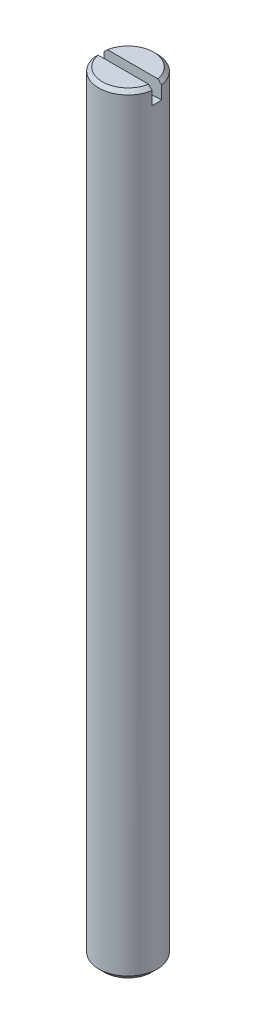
ISO-10303-21;
HEADER;
FILE_DESCRIPTION(('STEP AP214'),'2;1');
FILE_NAME('part.step','',(''),(''),'','','');
FILE_SCHEMA(('AUTOMOTIVE_DESIGN { 1 0 10303 214 1 1 1 1 }'));
ENDSEC;
DATA;
#1=APPLICATION_CONTEXT('core data for automotive mechanical design processes');
#2=APPLICATION_PROTOCOL_DEFINITION('international standard','automotive_design',2000,#1);
#3=PRODUCT_CONTEXT('',#1,'mechanical');
#4=PRODUCT('Part','Part','',(#3));
#5=PRODUCT_RELATED_PRODUCT_CATEGORY('part','',(#4));
#6=PRODUCT_DEFINITION_FORMATION('','',#4);
#7=PRODUCT_DEFINITION_CONTEXT('part definition',#1,'design');
#8=PRODUCT_DEFINITION('design','',#6,#7);
#9=PRODUCT_DEFINITION_SHAPE('','',#8);
#10=(LENGTH_UNIT() NAMED_UNIT(*) SI_UNIT(.MILLI.,.METRE.));
#11=(NAMED_UNIT(*) PLANE_ANGLE_UNIT() SI_UNIT($,.RADIAN.));
#12=(NAMED_UNIT(*) SI_UNIT($,.STERADIAN.) SOLID_ANGLE_UNIT());
#13=UNCERTAINTY_MEASURE_WITH_UNIT(LENGTH_MEASURE(1.E-05),#10,'distance_accuracy_value','');
#14=(GEOMETRIC_REPRESENTATION_CONTEXT(3) GLOBAL_UNCERTAINTY_ASSIGNED_CONTEXT((#13)) GLOBAL_UNIT_ASSIGNED_CONTEXT((#10,
#11,#12)) REPRESENTATION_CONTEXT('',''));
#15=CARTESIAN_POINT('',(0.,0.,0.));
#16=DIRECTION('',(0.,0.,1.));
#17=DIRECTION('',(1.,0.,0.));
#18=AXIS2_PLACEMENT_3D('',#15,#16,#17);
#19=CARTESIAN_POINT('',(0.,36.,0.));
#20=DIRECTION('',(0.,-1.,0.));
#21=DIRECTION('',(0.,0.,-1.));
#22=AXIS2_PLACEMENT_3D('',#19,#20,#21);
#23=PLANE('',#22);
#24=CARTESIAN_POINT('',(0.,36.0000000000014,0.));
#25=DIRECTION('',(0.,-1.,0.));
#26=DIRECTION('',(0.,0.,-1.));
#27=AXIS2_PLACEMENT_3D('',#24,#25,#26);
#28=CIRCLE('',#27,2.19349999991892);
#29=CARTESIAN_POINT('',(-2.15672025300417,35.9999999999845,-0.4));
#30=VERTEX_POINT('',#29);
#31=CARTESIAN_POINT('',(2.15672025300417,35.9999999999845,-0.4));
#32=VERTEX_POINT('',#31);
#33=EDGE_CURVE('E165',#30,#32,#28,.T.);
#34=ORIENTED_EDGE('',*,*,#33,.F.);
#35=DIRECTION('',(1.,0.,0.));
#36=VECTOR('',#35,1.);
#37=CARTESIAN_POINT('',(0.,36.,-0.4));
#38=LINE('',#37,#36);
#39=EDGE_CURVE('E163',#32,#30,#38,.F.);
#40=ORIENTED_EDGE('',*,*,#39,.F.);
#41=EDGE_LOOP('',(#34,#40));
#42=FACE_BOUND('',#41,.T.);
#43=ADVANCED_FACE('F14',(#42),#23,.F.);
#44=CARTESIAN_POINT('',(0.,36.,0.));
#45=DIRECTION('',(0.,-1.,0.));
#46=DIRECTION('',(0.,0.,-1.));
#47=AXIS2_PLACEMENT_3D('',#44,#45,#46);
#48=PLANE('',#47);
#49=DIRECTION('',(1.,0.,0.));
#50=VECTOR('',#49,1.);
#51=CARTESIAN_POINT('',(0.,36.,0.4));
#52=LINE('',#51,#50);
#53=CARTESIAN_POINT('',(-2.15672025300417,35.9999999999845,0.4));
#54=VERTEX_POINT('',#53);
#55=CARTESIAN_POINT('',(2.15672025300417,35.9999999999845,0.4));
#56=VERTEX_POINT('',#55);
#57=EDGE_CURVE('E161',#54,#56,#52,.T.);
#58=ORIENTED_EDGE('',*,*,#57,.F.);
#59=CARTESIAN_POINT('',(0.,36.0000000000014,0.));
#60=DIRECTION('',(0.,-1.,0.));
#61=DIRECTION('',(0.,0.,-1.));
#62=AXIS2_PLACEMENT_3D('',#59,#60,#61);
#63=CIRCLE('',#62,2.19349999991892);
#64=EDGE_CURVE('E159',#56,#54,#63,.T.);
#65=ORIENTED_EDGE('',*,*,#64,.F.);
#66=EDGE_LOOP('',(#58,#65));
#67=FACE_BOUND('',#66,.T.);
#68=ADVANCED_FACE('F121',(#67),#48,.F.);
#69=CARTESIAN_POINT('',(0.,35.6934999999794,0.));
#70=DIRECTION('',(0.,-1.,0.));
#71=DIRECTION('',(0.,0.,-1.));
#72=AXIS2_PLACEMENT_3D('',#69,#70,#71);
#73=CONICAL_SURFACE('',#72,2.49999999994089,0.785398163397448);
#74=CARTESIAN_POINT('',(-2.15672025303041,35.9999999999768,-0.400000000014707));
#75=CARTESIAN_POINT('',(-2.20861576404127,35.9489675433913,-0.400000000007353));
#76=CARTESIAN_POINT('',(-2.26048621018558,35.8979096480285,-0.400000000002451));
#77=CARTESIAN_POINT('',(-2.36417697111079,35.7957429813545,-0.399999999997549));
#78=CARTESIAN_POINT('',(-2.41599728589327,35.7446342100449,-0.399999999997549));
#79=CARTESIAN_POINT('',(-2.46779253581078,35.6934999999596,-0.4));
#80=B_SPLINE_CURVE_WITH_KNOTS('',3,(#74,#75,#76,#77,#78,#79),.UNSPECIFIED.,.F.,.F.,(4,2,4),(0.,
0.218350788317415,0.436701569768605),.UNSPECIFIED.);
#81=CARTESIAN_POINT('',(-2.46779253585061,35.6934999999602,-0.4));
#82=VERTEX_POINT('',#81);
#83=EDGE_CURVE('E39',#30,#82,#80,.T.);
#84=ORIENTED_EDGE('',*,*,#83,.F.);
#85=ORIENTED_EDGE('',*,*,#33,.T.);
#86=CARTESIAN_POINT('',(2.46779253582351,35.6934999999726,-0.400000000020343));
#87=CARTESIAN_POINT('',(2.41599728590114,35.7446342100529,-0.400000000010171));
#88=CARTESIAN_POINT('',(2.36417697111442,35.7957429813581,-0.400000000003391));
#89=CARTESIAN_POINT('',(2.26048621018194,35.8979096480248,-0.39999999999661));
#90=CARTESIAN_POINT('',(2.20861576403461,35.9489675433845,-0.39999999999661));
#91=CARTESIAN_POINT('',(2.15672025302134,35.9999999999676,-0.4));
#92=B_SPLINE_CURVE_WITH_KNOTS('',3,(#86,#87,#88,#89,#90,#91),.UNSPECIFIED.,.F.,.F.,(4,2,4),(0.,
0.218350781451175,0.436701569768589),.UNSPECIFIED.);
#93=CARTESIAN_POINT('',(2.46779253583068,35.6934999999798,-0.4));
#94=VERTEX_POINT('',#93);
#95=EDGE_CURVE('E134',#94,#32,#92,.T.);
#96=ORIENTED_EDGE('',*,*,#95,.F.);
#97=CARTESIAN_POINT('',(0.,35.6935,0.));
#98=DIRECTION('',(0.,-1.,0.));
#99=DIRECTION('',(0.,0.,-1.));
#100=AXIS2_PLACEMENT_3D('',#97,#98,#99);
#101=CIRCLE('',#100,2.5);
#102=EDGE_CURVE('E9',#82,#94,#101,.T.);
#103=ORIENTED_EDGE('',*,*,#102,.F.);
#104=EDGE_LOOP('',(#84,#85,#96,#103));
#105=FACE_BOUND('',#104,.T.);
#106=ADVANCED_FACE('F116',(#105),#73,.T.);
#107=CARTESIAN_POINT('',(0.,66.,-0.4));
#108=DIRECTION('',(0.,0.,1.));
#109=DIRECTION('',(1.,0.,0.));
#110=AXIS2_PLACEMENT_3D('',#107,#108,#109);
#111=PLANE('',#110);
#112=ORIENTED_EDGE('',*,*,#39,.T.);
#113=ORIENTED_EDGE('',*,*,#83,.T.);
#114=DIRECTION('',(0.,1.,0.));
#115=VECTOR('',#114,1.);
#116=CARTESIAN_POINT('',(-2.46779253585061,66.,-0.4));
#117=LINE('',#116,#115);
#118=CARTESIAN_POINT('',(-2.46779253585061,34.596815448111,-0.4));
#119=VERTEX_POINT('',#118);
#120=EDGE_CURVE('E154',#82,#119,#117,.F.);
#121=ORIENTED_EDGE('',*,*,#120,.T.);
#122=CARTESIAN_POINT('',(0.,66.,-0.4));
#123=DIRECTION('',(0.,0.,-1.));
#124=DIRECTION('',(-1.,0.,0.));
#125=AXIS2_PLACEMENT_3D('',#122,#123,#124);
#126=CIRCLE('',#125,31.5);
#127=CARTESIAN_POINT('',(2.46779253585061,34.596815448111,-0.4));
#128=VERTEX_POINT('',#127);
#129=EDGE_CURVE('E88',#119,#128,#126,.F.);
#130=ORIENTED_EDGE('',*,*,#129,.T.);
#131=DIRECTION('',(0.,1.,0.));
#132=VECTOR('',#131,1.);
#133=CARTESIAN_POINT('',(2.46779253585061,66.,-0.4));
#134=LINE('',#133,#132);
#135=EDGE_CURVE('E140',#128,#94,#134,.T.);
#136=ORIENTED_EDGE('',*,*,#135,.T.);
#137=ORIENTED_EDGE('',*,*,#95,.T.);
#138=EDGE_LOOP('',(#112,#113,#121,#130,#136,#137));
#139=FACE_BOUND('',#138,.T.);
#140=ADVANCED_FACE('F120',(#139),#111,.T.);
#141=CARTESIAN_POINT('',(0.,35.6934999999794,0.));
#142=DIRECTION('',(0.,-1.,0.));
#143=DIRECTION('',(0.,0.,-1.));
#144=AXIS2_PLACEMENT_3D('',#141,#142,#143);
#145=CONICAL_SURFACE('',#144,2.49999999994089,0.785398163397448);
#146=ORIENTED_EDGE('',*,*,#64,.T.);
#147=CARTESIAN_POINT('',(-2.15672025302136,35.9999999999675,0.4));
#148=CARTESIAN_POINT('',(-2.20861576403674,35.9489675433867,0.4));
#149=CARTESIAN_POINT('',(-2.26048621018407,35.8979096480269,0.4));
#150=CARTESIAN_POINT('',(-2.36417697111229,35.795742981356,0.4));
#151=CARTESIAN_POINT('',(-2.41599728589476,35.7446342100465,0.4));
#152=CARTESIAN_POINT('',(-2.46779253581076,35.6934999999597,0.4));
#153=B_SPLINE_CURVE_WITH_KNOTS('',3,(#147,#148,#149,#150,#151,#152),.UNSPECIFIED.,.F.,.F.,(4,2,
4),(0.,0.218350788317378,0.436701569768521),.UNSPECIFIED.);
#154=CARTESIAN_POINT('',(-2.46779253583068,35.6934999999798,0.4));
#155=VERTEX_POINT('',#154);
#156=EDGE_CURVE('E149',#54,#155,#153,.T.);
#157=ORIENTED_EDGE('',*,*,#156,.T.);
#158=CARTESIAN_POINT('',(0.,35.6935,0.));
#159=DIRECTION('',(0.,-1.,0.));
#160=DIRECTION('',(0.,0.,-1.));
#161=AXIS2_PLACEMENT_3D('',#158,#159,#160);
#162=CIRCLE('',#161,2.5);
#163=CARTESIAN_POINT('',(2.46779253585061,35.6934999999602,0.4));
#164=VERTEX_POINT('',#163);
#165=EDGE_CURVE('E30',#164,#155,#162,.T.);
#166=ORIENTED_EDGE('',*,*,#165,.F.);
#167=CARTESIAN_POINT('',(2.46779253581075,35.6934999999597,0.4));
#168=CARTESIAN_POINT('',(2.41599728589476,35.7446342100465,0.4));
#169=CARTESIAN_POINT('',(2.36417697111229,35.795742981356,0.4));
#170=CARTESIAN_POINT('',(2.26048621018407,35.8979096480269,0.4));
#171=CARTESIAN_POINT('',(2.20861576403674,35.9489675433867,0.4));
#172=CARTESIAN_POINT('',(2.15672025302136,35.9999999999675,0.4));
#173=B_SPLINE_CURVE_WITH_KNOTS('',3,(#167,#168,#169,#170,#171,#172),.UNSPECIFIED.,.F.,.F.,(4,2,
4),(0.,0.218350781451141,0.436701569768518),.UNSPECIFIED.);
#174=EDGE_CURVE('E96',#164,#56,#173,.T.);
#175=ORIENTED_EDGE('',*,*,#174,.T.);
#176=EDGE_LOOP('',(#146,#157,#166,#175));
#177=FACE_BOUND('',#176,.T.);
#178=ADVANCED_FACE('F122',(#177),#145,.T.);
#179=CARTESIAN_POINT('',(0.,66.,0.4));
#180=DIRECTION('',(0.,0.,1.));
#181=DIRECTION('',(1.,0.,0.));
#182=AXIS2_PLACEMENT_3D('',#179,#180,#181);
#183=PLANE('',#182);
#184=ORIENTED_EDGE('',*,*,#57,.T.);
#185=ORIENTED_EDGE('',*,*,#174,.F.);
#186=DIRECTION('',(0.,1.,0.));
#187=VECTOR('',#186,1.);
#188=CARTESIAN_POINT('',(2.46779253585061,66.,0.4));
#189=LINE('',#188,#187);
#190=CARTESIAN_POINT('',(2.46779253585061,34.596815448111,0.4));
#191=VERTEX_POINT('',#190);
#192=EDGE_CURVE('E94',#191,#164,#189,.T.);
#193=ORIENTED_EDGE('',*,*,#192,.F.);
#194=CARTESIAN_POINT('',(0.,66.,0.4));
#195=DIRECTION('',(0.,0.,-1.));
#196=DIRECTION('',(-1.,0.,0.));
#197=AXIS2_PLACEMENT_3D('',#194,#195,#196);
#198=CIRCLE('',#197,31.5);
#199=CARTESIAN_POINT('',(-2.46779253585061,34.596815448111,0.4));
#200=VERTEX_POINT('',#199);
#201=EDGE_CURVE('E81',#200,#191,#198,.F.);
#202=ORIENTED_EDGE('',*,*,#201,.F.);
#203=DIRECTION('',(0.,1.,0.));
#204=VECTOR('',#203,1.);
#205=CARTESIAN_POINT('',(-2.46779253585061,66.,0.4));
#206=LINE('',#205,#204);
#207=EDGE_CURVE('E73',#155,#200,#206,.F.);
#208=ORIENTED_EDGE('',*,*,#207,.F.);
#209=ORIENTED_EDGE('',*,*,#156,.F.);
#210=EDGE_LOOP('',(#184,#185,#193,#202,#208,#209));
#211=FACE_BOUND('',#210,.T.);
#212=ADVANCED_FACE('F92',(#211),#183,.F.);
#213=CARTESIAN_POINT('',(0.,66.,0.4));
#214=DIRECTION('',(0.,0.,-1.));
#215=DIRECTION('',(-1.,0.,0.));
#216=AXIS2_PLACEMENT_3D('',#213,#214,#215);
#217=CYLINDRICAL_SURFACE('',#216,31.5);
#218=CARTESIAN_POINT('',(2.46779253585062,34.596815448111,-0.4));
#219=CARTESIAN_POINT('',(2.47854531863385,34.5976618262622,-0.333698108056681));
#220=CARTESIAN_POINT('',(2.48661458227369,34.598300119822,-0.266959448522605));
#221=CARTESIAN_POINT('',(2.49732458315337,34.5991493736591,-0.133478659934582));
#222=CARTESIAN_POINT('',(2.5,34.5993630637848,-0.066739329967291));
#223=CARTESIAN_POINT('',(2.5,34.5993630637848,0.066739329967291));
#224=CARTESIAN_POINT('',(2.49732458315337,34.5991493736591,0.133478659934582));
#225=CARTESIAN_POINT('',(2.48661458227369,34.598300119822,0.266959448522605));
#226=CARTESIAN_POINT('',(2.47854531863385,34.5976618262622,0.333698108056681));
#227=CARTESIAN_POINT('',(2.46779253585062,34.596815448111,0.4));
#228=B_SPLINE_CURVE_WITH_KNOTS('',3,(#218,#219,#220,#221,#222,#223,#224,#225,#226,#227),
.UNSPECIFIED.,.F.,.F.,(4,2,2,2,4),(0.,0.201464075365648,0.401628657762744,0.601793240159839,
0.803257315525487),.UNSPECIFIED.);
#229=EDGE_CURVE('E82',#128,#191,#228,.T.);
#230=ORIENTED_EDGE('',*,*,#229,.F.);
#231=ORIENTED_EDGE('',*,*,#129,.F.);
#232=CARTESIAN_POINT('',(-2.46779253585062,34.596815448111,0.4));
#233=CARTESIAN_POINT('',(-2.47854531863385,34.5976618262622,0.333698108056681));
#234=CARTESIAN_POINT('',(-2.48661458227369,34.598300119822,0.266959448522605));
#235=CARTESIAN_POINT('',(-2.49732458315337,34.5991493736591,0.133478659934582));
#236=CARTESIAN_POINT('',(-2.5,34.5993630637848,0.066739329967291));
#237=CARTESIAN_POINT('',(-2.5,34.5993630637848,-0.066739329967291));
#238=CARTESIAN_POINT('',(-2.49732458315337,34.5991493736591,-0.133478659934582));
#239=CARTESIAN_POINT('',(-2.48661458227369,34.598300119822,-0.266959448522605));
#240=CARTESIAN_POINT('',(-2.47854531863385,34.5976618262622,-0.333698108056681));
#241=CARTESIAN_POINT('',(-2.46779253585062,34.596815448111,-0.4));
#242=B_SPLINE_CURVE_WITH_KNOTS('',3,(#232,#233,#234,#235,#236,#237,#238,#239,#240,#241),
.UNSPECIFIED.,.F.,.F.,(4,2,2,2,4),(0.,0.201464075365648,0.401628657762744,0.601793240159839,
0.803257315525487),.UNSPECIFIED.);
#243=EDGE_CURVE('E19',#200,#119,#242,.T.);
#244=ORIENTED_EDGE('',*,*,#243,.F.);
#245=ORIENTED_EDGE('',*,*,#201,.T.);
#246=EDGE_LOOP('',(#230,#231,#244,#245));
#247=FACE_BOUND('',#246,.T.);
#248=ADVANCED_FACE('F16',(#247),#217,.F.);
#249=CARTESIAN_POINT('',(0.,26.5,0.));
#250=DIRECTION('',(0.,-1.,0.));
#251=DIRECTION('',(0.,0.,-1.));
#252=AXIS2_PLACEMENT_3D('',#249,#250,#251);
#253=CYLINDRICAL_SURFACE('',#252,2.5);
#254=ORIENTED_EDGE('',*,*,#229,.T.);
#255=ORIENTED_EDGE('',*,*,#192,.T.);
#256=ORIENTED_EDGE('',*,*,#165,.T.);
#257=ORIENTED_EDGE('',*,*,#207,.T.);
#258=ORIENTED_EDGE('',*,*,#243,.T.);
#259=ORIENTED_EDGE('',*,*,#120,.F.);
#260=ORIENTED_EDGE('',*,*,#102,.T.);
#261=ORIENTED_EDGE('',*,*,#135,.F.);
#262=EDGE_LOOP('',(#254,#255,#256,#257,#258,#259,#260,#261));
#263=FACE_BOUND('',#262,.T.);
#264=CARTESIAN_POINT('',(0.,-29.5095,0.));
#265=DIRECTION('',(0.,-1.,0.));
#266=DIRECTION('',(0.,0.,-1.));
#267=AXIS2_PLACEMENT_3D('',#264,#265,#266);
#268=CIRCLE('',#267,2.5);
#269=CARTESIAN_POINT('',(0.,-29.5095,-2.5));
#270=VERTEX_POINT('',#269);
#271=EDGE_CURVE('E172',#270,#270,#268,.F.);
#272=ORIENTED_EDGE('',*,*,#271,.T.);
#273=EDGE_LOOP('',(#272));
#274=FACE_BOUND('',#273,.T.);
#275=ADVANCED_FACE('F75',(#263,#274),#253,.T.);
#276=CARTESIAN_POINT('',(2.0095,-30.,0.));
#277=DIRECTION('',(0.,1.,0.));
#278=DIRECTION('',(0.,0.,1.));
#279=AXIS2_PLACEMENT_3D('',#276,#277,#278);
#280=PLANE('',#279);
#281=CARTESIAN_POINT('',(0.,-30.0000000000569,0.));
#282=DIRECTION('',(0.,1.,0.));
#283=DIRECTION('',(0.,0.,1.));
#284=AXIS2_PLACEMENT_3D('',#281,#282,#283);
#285=CIRCLE('',#284,2.00949999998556);
#286=CARTESIAN_POINT('',(0.,-30.0000000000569,2.00949999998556));
#287=VERTEX_POINT('',#286);
#288=EDGE_CURVE('E90',#287,#287,#285,.T.);
#289=ORIENTED_EDGE('',*,*,#288,.F.);
#290=EDGE_LOOP('',(#289));
#291=FACE_BOUND('',#290,.T.);
#292=ADVANCED_FACE('F113',(#291),#280,.F.);
#293=CARTESIAN_POINT('',(0.,-29.5094999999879,0.));
#294=DIRECTION('',(0.,1.,0.));
#295=DIRECTION('',(0.,0.,1.));
#296=AXIS2_PLACEMENT_3D('',#293,#294,#295);
#297=CONICAL_SURFACE('',#296,2.50000000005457,0.785398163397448);
#298=ORIENTED_EDGE('',*,*,#271,.F.);
#299=EDGE_LOOP('',(#298));
#300=FACE_BOUND('',#299,.T.);
#301=ORIENTED_EDGE('',*,*,#288,.T.);
#302=EDGE_LOOP('',(#301));
#303=FACE_BOUND('',#302,.T.);
#304=ADVANCED_FACE('F114',(#300,#303),#297,.T.);
#305=CLOSED_SHELL('',(#43,#68,#106,#140,#178,#212,#248,#275,#292,#304));
#306=MANIFOLD_SOLID_BREP('B1',#305);
#307=ADVANCED_BREP_SHAPE_REPRESENTATION('',(#18,#306),#14);
#308=SHAPE_DEFINITION_REPRESENTATION(#9,#307);
ENDSEC;
END-ISO-10303-21;
